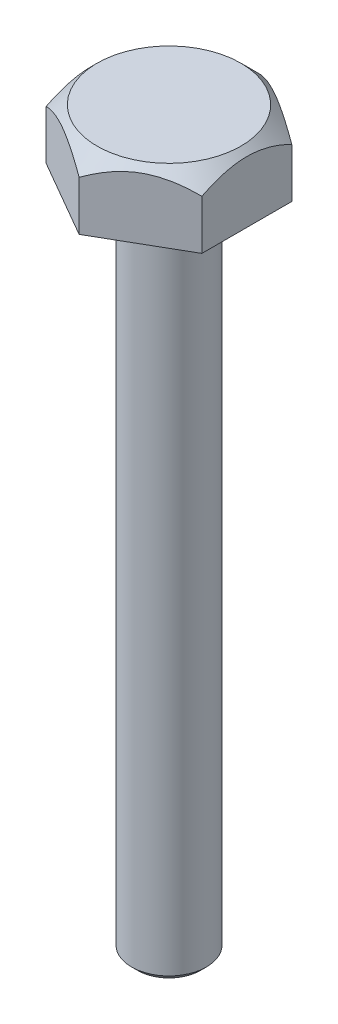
ISO-10303-21;
HEADER;
FILE_DESCRIPTION(('STEP AP214'),'2;1');
FILE_NAME('part.step','',(''),(''),'','','');
FILE_SCHEMA(('AUTOMOTIVE_DESIGN { 1 0 10303 214 1 1 1 1 }'));
ENDSEC;
DATA;
#1=APPLICATION_CONTEXT('core data for automotive mechanical design processes');
#2=APPLICATION_PROTOCOL_DEFINITION('international standard','automotive_design',2000,#1);
#3=PRODUCT_CONTEXT('',#1,'mechanical');
#4=PRODUCT('Part','Part','',(#3));
#5=PRODUCT_RELATED_PRODUCT_CATEGORY('part','',(#4));
#6=PRODUCT_DEFINITION_FORMATION('','',#4);
#7=PRODUCT_DEFINITION_CONTEXT('part definition',#1,'design');
#8=PRODUCT_DEFINITION('design','',#6,#7);
#9=PRODUCT_DEFINITION_SHAPE('','',#8);
#10=(LENGTH_UNIT() NAMED_UNIT(*) SI_UNIT(.MILLI.,.METRE.));
#11=(NAMED_UNIT(*) PLANE_ANGLE_UNIT() SI_UNIT($,.RADIAN.));
#12=(NAMED_UNIT(*) SI_UNIT($,.STERADIAN.) SOLID_ANGLE_UNIT());
#13=UNCERTAINTY_MEASURE_WITH_UNIT(LENGTH_MEASURE(1.E-05),#10,'distance_accuracy_value','');
#14=(GEOMETRIC_REPRESENTATION_CONTEXT(3) GLOBAL_UNCERTAINTY_ASSIGNED_CONTEXT((#13)) GLOBAL_UNIT_ASSIGNED_CONTEXT((#10,
#11,#12)) REPRESENTATION_CONTEXT('',''));
#15=CARTESIAN_POINT('',(0.,0.,0.));
#16=DIRECTION('',(0.,0.,1.));
#17=DIRECTION('',(1.,0.,0.));
#18=AXIS2_PLACEMENT_3D('',#15,#16,#17);
#19=CARTESIAN_POINT('',(-51.9615242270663,45.,30.));
#20=DIRECTION('',(0.5,0.,-0.866025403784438));
#21=DIRECTION('',(-0.866025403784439,0.,-0.5));
#22=AXIS2_PLACEMENT_3D('',#19,#20,#21);
#23=PLANE('',#22);
#24=DIRECTION('',(0.,-1.,0.));
#25=VECTOR('',#24,1.);
#26=CARTESIAN_POINT('',(0.,45.,60.));
#27=LINE('',#26,#25);
#28=CARTESIAN_POINT('',(0.,33.,60.));
#29=VERTEX_POINT('',#28);
#30=CARTESIAN_POINT('',(0.,0.,60.));
#31=VERTEX_POINT('',#30);
#32=EDGE_CURVE('E124',#29,#31,#27,.T.);
#33=ORIENTED_EDGE('',*,*,#32,.F.);
#34=CARTESIAN_POINT('',(0.000199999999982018,32.9998845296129,60.0001154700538));
#35=CARTESIAN_POINT('',(-0.446473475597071,33.257768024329,59.742228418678));
#36=CARTESIAN_POINT('',(-0.894867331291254,33.511667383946,59.48334810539));
#37=CARTESIAN_POINT('',(-1.79523609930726,34.0109203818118,58.963519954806));
#38=CARTESIAN_POINT('',(-2.24721119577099,34.2562735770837,58.7025720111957));
#39=CARTESIAN_POINT('',(-3.60908692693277,34.9788404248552,57.9162926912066));
#40=CARTESIAN_POINT('',(-4.52450736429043,35.4423114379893,57.3877744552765));
#41=CARTESIAN_POINT('',(-6.37580546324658,36.3297114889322,56.3189269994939));
#42=CARTESIAN_POINT('',(-7.31177024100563,36.7533989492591,55.7785474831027));
#43=CARTESIAN_POINT('',(-9.19908082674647,37.5520758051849,54.6889082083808));
#44=CARTESIAN_POINT('',(-10.1504242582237,37.9270726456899,54.1396498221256));
#45=CARTESIAN_POINT('',(-12.0531098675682,38.6164656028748,53.0411337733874));
#46=CARTESIAN_POINT('',(-13.004217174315,38.9317213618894,52.4920117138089));
#47=CARTESIAN_POINT('',(-14.9199226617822,39.5025105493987,51.3859786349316));
#48=CARTESIAN_POINT('',(-15.8845215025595,39.7580410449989,50.8290672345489));
#49=CARTESIAN_POINT('',(-17.8228197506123,40.2028769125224,49.7099902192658));
#50=CARTESIAN_POINT('',(-18.7964924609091,40.3923364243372,49.1478400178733));
#51=CARTESIAN_POINT('',(-20.7521341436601,40.7008476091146,48.0187497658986));
#52=CARTESIAN_POINT('',(-21.7341018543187,40.8199098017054,47.4518104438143));
#53=CARTESIAN_POINT('',(-23.4226474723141,40.9609139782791,46.4769281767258));
#54=CARTESIAN_POINT('',(-24.128131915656,41.0008457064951,46.0696165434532));
#55=CARTESIAN_POINT('',(-25.5399358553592,41.0423687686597,45.2545111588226));
#56=CARTESIAN_POINT('',(-26.2462553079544,41.0439620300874,44.8467174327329));
#57=CARTESIAN_POINT('',(-27.6584230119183,41.0087702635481,44.0314020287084));
#58=CARTESIAN_POINT('',(-28.3642710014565,40.9719713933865,43.6238805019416));
#59=CARTESIAN_POINT('',(-29.7737274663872,40.8605427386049,42.8101304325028));
#60=CARTESIAN_POINT('',(-30.4773359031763,40.7859123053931,42.4039019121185));
#61=CARTESIAN_POINT('',(-31.8816436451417,40.5998306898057,41.5931244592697));
#62=CARTESIAN_POINT('',(-32.5823390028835,40.4883399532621,41.1885778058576));
#63=CARTESIAN_POINT('',(-33.9788282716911,40.2301353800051,40.3823143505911));
#64=CARTESIAN_POINT('',(-34.6746221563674,40.0834213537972,39.9805975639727));
#65=CARTESIAN_POINT('',(-36.0601894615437,39.756722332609,39.1806399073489));
#66=CARTESIAN_POINT('',(-36.7499638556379,39.5767428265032,38.7823984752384));
#67=CARTESIAN_POINT('',(-38.1228790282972,39.1856485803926,37.9897455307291));
#68=CARTESIAN_POINT('',(-38.8060192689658,38.9745313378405,37.5953343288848));
#69=CARTESIAN_POINT('',(-40.5647294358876,38.3907949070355,36.5799425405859));
#70=CARTESIAN_POINT('',(-41.6348611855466,37.9962040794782,35.9621016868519));
#71=CARTESIAN_POINT('',(-43.7557928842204,37.1434830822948,34.7375811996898));
#72=CARTESIAN_POINT('',(-44.8065922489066,36.6853509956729,34.1309019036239));
#73=CARTESIAN_POINT('',(-46.885750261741,35.7157175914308,32.9304994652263));
#74=CARTESIAN_POINT('',(-47.9141678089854,35.2043841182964,32.3367423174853));
#75=CARTESIAN_POINT('',(-49.4425794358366,34.4024899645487,31.4543134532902));
#76=CARTESIAN_POINT('',(-49.9495483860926,34.1294532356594,31.1616147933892));
#77=CARTESIAN_POINT('',(-50.9589715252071,33.5725705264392,30.5788240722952));
#78=CARTESIAN_POINT('',(-51.4614260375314,33.2887253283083,30.2887318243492));
#79=CARTESIAN_POINT('',(-51.9617242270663,32.9998845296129,29.9998845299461));
#80=B_SPLINE_CURVE_WITH_KNOTS('',3,(#34,#35,#36,#37,#38,#39,#40,#41,#42,#43,#44,#45,#46,#47,#48,
#49,#50,#51,#52,#53,#54,#55,#56,#57,#58,#59,#60,#61,#62,#63,#64,#65,#66,#67,#68,#69,#70,#71,#72,
#73,#74,#75,#76,#77,#78,#79),.UNSPECIFIED.,.F.,.F.,(4,2,2,2,2,2,2,2,2,2,2,2,2,2,2,2,2,2,2,2,2,2,
4),(0.,1.72992162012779,3.45993277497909,6.92162378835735,10.4031336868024,13.8841106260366,
17.310390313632,20.7368382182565,24.1552380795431,27.5731269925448,30.0190953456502,
32.4649407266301,34.9116682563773,37.3584377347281,39.8078413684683,42.2572581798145,
44.7062711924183,47.1554811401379,51.0447978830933,54.9342319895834,58.8117474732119,
60.7494784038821,62.6870693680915),.UNSPECIFIED.);
#81=CARTESIAN_POINT('',(-51.9615242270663,33.,30.));
#82=VERTEX_POINT('',#81);
#83=EDGE_CURVE('E185',#29,#82,#80,.T.);
#84=ORIENTED_EDGE('',*,*,#83,.T.);
#85=DIRECTION('',(0.,-1.,0.));
#86=VECTOR('',#85,1.);
#87=CARTESIAN_POINT('',(-51.9615242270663,45.,30.));
#88=LINE('',#87,#86);
#89=CARTESIAN_POINT('',(-51.9615242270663,0.,30.));
#90=VERTEX_POINT('',#89);
#91=EDGE_CURVE('E65',#82,#90,#88,.T.);
#92=ORIENTED_EDGE('',*,*,#91,.T.);
#93=DIRECTION('',(0.866025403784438,0.,0.5));
#94=VECTOR('',#93,1.);
#95=CARTESIAN_POINT('',(-51.9615242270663,0.,30.));
#96=LINE('',#95,#94);
#97=EDGE_CURVE('E203',#90,#31,#96,.T.);
#98=ORIENTED_EDGE('',*,*,#97,.T.);
#99=EDGE_LOOP('',(#33,#84,#92,#98));
#100=FACE_BOUND('',#99,.T.);
#101=ADVANCED_FACE('F41',(#100),#23,.F.);
#102=CARTESIAN_POINT('',(0.,45.,60.));
#103=DIRECTION('',(-0.5,0.,-0.866025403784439));
#104=DIRECTION('',(-0.866025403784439,0.,0.5));
#105=AXIS2_PLACEMENT_3D('',#102,#103,#104);
#106=PLANE('',#105);
#107=DIRECTION('',(0.,-1.,0.));
#108=VECTOR('',#107,1.);
#109=CARTESIAN_POINT('',(51.9615242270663,45.,30.));
#110=LINE('',#109,#108);
#111=CARTESIAN_POINT('',(51.9615242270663,33.,30.0000000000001));
#112=VERTEX_POINT('',#111);
#113=CARTESIAN_POINT('',(51.9615242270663,0.,30.));
#114=VERTEX_POINT('',#113);
#115=EDGE_CURVE('E118',#112,#114,#110,.T.);
#116=ORIENTED_EDGE('',*,*,#115,.F.);
#117=CARTESIAN_POINT('',(51.9617242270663,32.9998845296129,29.9998845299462));
#118=CARTESIAN_POINT('',(51.5150507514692,33.257768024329,30.257771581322));
#119=CARTESIAN_POINT('',(51.0666568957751,33.511667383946,30.51665189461));
#120=CARTESIAN_POINT('',(50.1662881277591,34.0109203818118,31.036480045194));
#121=CARTESIAN_POINT('',(49.7143130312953,34.2562735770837,31.2974279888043));
#122=CARTESIAN_POINT('',(48.3524373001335,34.9788404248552,32.0837073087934));
#123=CARTESIAN_POINT('',(47.4370168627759,35.4423114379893,32.6122255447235));
#124=CARTESIAN_POINT('',(45.5857187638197,36.3297114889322,33.6810730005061));
#125=CARTESIAN_POINT('',(44.6497539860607,36.7533989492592,34.2214525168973));
#126=CARTESIAN_POINT('',(42.7624434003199,37.5520758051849,35.3110917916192));
#127=CARTESIAN_POINT('',(41.8110999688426,37.9270726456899,35.8603501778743));
#128=CARTESIAN_POINT('',(39.9084143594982,38.6164656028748,36.9588662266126));
#129=CARTESIAN_POINT('',(38.9573070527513,38.9317213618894,37.5079882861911));
#130=CARTESIAN_POINT('',(37.0416015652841,39.5025105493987,38.6140213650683));
#131=CARTESIAN_POINT('',(36.0770027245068,39.758041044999,39.1709327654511));
#132=CARTESIAN_POINT('',(34.138704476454,40.2028769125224,40.2900097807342));
#133=CARTESIAN_POINT('',(33.1650317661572,40.3923364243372,40.8521599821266));
#134=CARTESIAN_POINT('',(31.2093900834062,40.7008476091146,41.9812502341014));
#135=CARTESIAN_POINT('',(30.2274223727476,40.8199098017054,42.5481895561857));
#136=CARTESIAN_POINT('',(28.5388767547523,40.9609139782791,43.5230718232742));
#137=CARTESIAN_POINT('',(27.8333923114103,41.0008457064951,43.9303834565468));
#138=CARTESIAN_POINT('',(26.4215883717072,41.0423687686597,44.7454888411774));
#139=CARTESIAN_POINT('',(25.7152689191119,41.0439620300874,45.1532825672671));
#140=CARTESIAN_POINT('',(24.303101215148,41.0087702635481,45.9685979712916));
#141=CARTESIAN_POINT('',(23.5972532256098,40.9719713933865,46.3761194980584));
#142=CARTESIAN_POINT('',(22.1877967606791,40.8605427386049,47.1898695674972));
#143=CARTESIAN_POINT('',(21.48418832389,40.7859123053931,47.5960980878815));
#144=CARTESIAN_POINT('',(20.0798805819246,40.5998306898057,48.4068755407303));
#145=CARTESIAN_POINT('',(19.3791852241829,40.4883399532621,48.8114221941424));
#146=CARTESIAN_POINT('',(17.9826959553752,40.2301353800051,49.6176856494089));
#147=CARTESIAN_POINT('',(17.286902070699,40.0834213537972,50.0194024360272));
#148=CARTESIAN_POINT('',(15.9013347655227,39.756722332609,50.8193600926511));
#149=CARTESIAN_POINT('',(15.2115603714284,39.5767428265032,51.2176015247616));
#150=CARTESIAN_POINT('',(13.8386451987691,39.1856485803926,52.0102544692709));
#151=CARTESIAN_POINT('',(13.1555049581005,38.9745313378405,52.4046656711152));
#152=CARTESIAN_POINT('',(11.3967947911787,38.3907949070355,53.4200574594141));
#153=CARTESIAN_POINT('',(10.3266630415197,37.9962040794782,54.037898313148));
#154=CARTESIAN_POINT('',(8.20573134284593,37.1434830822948,55.2624188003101));
#155=CARTESIAN_POINT('',(7.15493197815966,36.6853509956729,55.869098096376));
#156=CARTESIAN_POINT('',(5.07577396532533,35.7157175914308,57.0695005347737));
#157=CARTESIAN_POINT('',(4.04735641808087,35.2043841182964,57.6632576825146));
#158=CARTESIAN_POINT('',(2.51894479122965,34.4024899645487,58.5456865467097));
#159=CARTESIAN_POINT('',(2.01197584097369,34.1294532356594,58.8383852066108));
#160=CARTESIAN_POINT('',(1.00255270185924,33.5725705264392,59.4211759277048));
#161=CARTESIAN_POINT('',(0.500098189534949,33.2887253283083,59.7112681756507));
#162=CARTESIAN_POINT('',(-0.000200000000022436,32.9998845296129,60.0001154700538));
#163=B_SPLINE_CURVE_WITH_KNOTS('',3,(#117,#118,#119,#120,#121,#122,#123,#124,#125,#126,#127,
#128,#129,#130,#131,#132,#133,#134,#135,#136,#137,#138,#139,#140,#141,#142,#143,#144,#145,#146,
#147,#148,#149,#150,#151,#152,#153,#154,#155,#156,#157,#158,#159,#160,#161,#162),.UNSPECIFIED.,
.F.,.F.,(4,2,2,2,2,2,2,2,2,2,2,2,2,2,2,2,2,2,2,2,2,2,4),(0.,1.72992162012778,3.4599327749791,
6.92162378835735,10.4031336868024,13.8841106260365,17.310390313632,20.7368382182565,
24.1552380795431,27.5731269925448,30.0190953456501,32.4649407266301,34.9116682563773,
37.3584377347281,39.8078413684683,42.2572581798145,44.7062711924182,47.1554811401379,
51.0447978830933,54.9342319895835,58.8117474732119,60.7494784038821,62.6870693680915),.UNSPECIFIED.);
#164=EDGE_CURVE('E178',#112,#29,#163,.T.);
#165=ORIENTED_EDGE('',*,*,#164,.T.);
#166=ORIENTED_EDGE('',*,*,#32,.T.);
#167=DIRECTION('',(0.866025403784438,0.,-0.5));
#168=VECTOR('',#167,1.);
#169=CARTESIAN_POINT('',(0.,0.,60.));
#170=LINE('',#169,#168);
#171=EDGE_CURVE('E207',#31,#114,#170,.T.);
#172=ORIENTED_EDGE('',*,*,#171,.T.);
#173=EDGE_LOOP('',(#116,#165,#166,#172));
#174=FACE_BOUND('',#173,.T.);
#175=ADVANCED_FACE('F191',(#174),#106,.F.);
#176=CARTESIAN_POINT('',(51.9615242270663,45.,30.));
#177=DIRECTION('',(-1.,0.,0.));
#178=DIRECTION('',(0.,0.,1.));
#179=AXIS2_PLACEMENT_3D('',#176,#177,#178);
#180=PLANE('',#179);
#181=DIRECTION('',(0.,-1.,0.));
#182=VECTOR('',#181,1.);
#183=CARTESIAN_POINT('',(51.9615242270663,45.,-30.));
#184=LINE('',#183,#182);
#185=CARTESIAN_POINT('',(51.9615242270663,33.,-30.));
#186=VERTEX_POINT('',#185);
#187=CARTESIAN_POINT('',(51.9615242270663,0.,-30.));
#188=VERTEX_POINT('',#187);
#189=EDGE_CURVE('E116',#186,#188,#184,.T.);
#190=ORIENTED_EDGE('',*,*,#189,.F.);
#191=CARTESIAN_POINT('',(51.9615242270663,-11.9539447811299,-91.1884341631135));
#192=CARTESIAN_POINT('',(51.9615242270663,-10.7839201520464,-89.8417320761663));
#193=CARTESIAN_POINT('',(51.9615242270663,-9.61745820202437,-88.4919233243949));
#194=CARTESIAN_POINT('',(51.9615242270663,-7.29270416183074,-85.7852524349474));
#195=CARTESIAN_POINT('',(51.9615242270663,-6.13441220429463,-84.4283901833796));
#196=CARTESIAN_POINT('',(51.9615242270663,-3.82654233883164,-81.7061808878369));
#197=CARTESIAN_POINT('',(51.9615242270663,-2.6769687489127,-80.3408301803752));
#198=CARTESIAN_POINT('',(51.9615242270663,-0.388401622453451,-77.6012929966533));
#199=CARTESIAN_POINT('',(51.9615242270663,0.750591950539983,-76.227106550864));
#200=CARTESIAN_POINT('',(51.9615242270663,3.04192952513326,-73.4377375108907));
#201=CARTESIAN_POINT('',(51.9615242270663,4.19399757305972,-72.0223280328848));
#202=CARTESIAN_POINT('',(51.9615242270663,6.4834398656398,-69.179658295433));
#203=CARTESIAN_POINT('',(51.9615242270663,7.62081407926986,-67.7523980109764));
#204=CARTESIAN_POINT('',(51.9615242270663,9.87814380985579,-64.8847053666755));
#205=CARTESIAN_POINT('',(51.9615242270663,10.9981034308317,-63.444276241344));
#206=CARTESIAN_POINT('',(51.9615242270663,13.2178668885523,-60.5479503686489));
#207=CARTESIAN_POINT('',(51.9615242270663,14.3176707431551,-59.0920536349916));
#208=CARTESIAN_POINT('',(51.9615242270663,16.4948023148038,-56.1605754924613));
#209=CARTESIAN_POINT('',(51.9615242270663,17.5720989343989,-54.6849709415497));
#210=CARTESIAN_POINT('',(51.9615242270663,19.6980400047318,-51.713203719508));
#211=CARTESIAN_POINT('',(51.9615242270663,20.7466841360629,-50.2170408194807));
#212=CARTESIAN_POINT('',(51.9615242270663,22.8102921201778,-47.1996672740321));
#213=CARTESIAN_POINT('',(51.9615242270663,23.8252262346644,-45.6784361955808));
#214=CARTESIAN_POINT('',(51.9615242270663,25.3158762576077,-43.3760511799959));
#215=CARTESIAN_POINT('',(51.9615242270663,25.8074716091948,-42.6051600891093));
#216=CARTESIAN_POINT('',(51.9615242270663,26.7789135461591,-41.0560174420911));
#217=CARTESIAN_POINT('',(51.9615242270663,27.2587603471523,-40.2777660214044));
#218=CARTESIAN_POINT('',(51.9615242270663,28.2019517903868,-38.7191054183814));
#219=CARTESIAN_POINT('',(51.9615242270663,28.6653916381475,-37.9387539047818));
#220=CARTESIAN_POINT('',(51.9615242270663,29.5779846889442,-36.3697576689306));
#221=CARTESIAN_POINT('',(51.9615242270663,30.0271382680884,-35.5811131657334));
#222=CARTESIAN_POINT('',(51.9615242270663,30.9096286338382,-33.9948329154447));
#223=CARTESIAN_POINT('',(51.9615242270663,31.342962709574,-33.1971956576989));
#224=CARTESIAN_POINT('',(51.9615242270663,32.191889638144,-31.5925596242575));
#225=CARTESIAN_POINT('',(51.9615242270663,32.6074831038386,-30.7855611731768));
#226=CARTESIAN_POINT('',(51.9615242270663,33.4183205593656,-29.1628148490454));
#227=CARTESIAN_POINT('',(51.9615242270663,33.8135929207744,-28.347081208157));
#228=CARTESIAN_POINT('',(51.9615242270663,34.5821197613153,-26.7053337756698));
#229=CARTESIAN_POINT('',(51.9615242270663,34.9553737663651,-25.8793197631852));
#230=CARTESIAN_POINT('',(51.9615242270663,36.0381625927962,-23.3857528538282));
#231=CARTESIAN_POINT('',(51.9615242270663,36.7111246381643,-21.7018840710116));
#232=CARTESIAN_POINT('',(51.9615242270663,37.6368932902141,-19.124219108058));
#233=CARTESIAN_POINT('',(51.9615242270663,37.9343551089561,-18.2462988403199));
#234=CARTESIAN_POINT('',(51.9615242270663,38.4943430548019,-16.4793427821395));
#235=CARTESIAN_POINT('',(51.9615242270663,38.7568706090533,-15.5903074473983));
#236=CARTESIAN_POINT('',(51.9615242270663,39.2435993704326,-13.8018426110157));
#237=CARTESIAN_POINT('',(51.9615242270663,39.4678033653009,-12.9024138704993));
#238=CARTESIAN_POINT('',(51.9615242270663,39.8746364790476,-11.0941512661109));
#239=CARTESIAN_POINT('',(51.9615242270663,40.0572654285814,-10.1853173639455));
#240=CARTESIAN_POINT('',(51.9615242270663,40.376948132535,-8.36556672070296));
#241=CARTESIAN_POINT('',(51.9615242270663,40.5142832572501,-7.45469964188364));
#242=CARTESIAN_POINT('',(51.9615242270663,40.7425323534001,-5.62714564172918));
#243=CARTESIAN_POINT('',(51.9615242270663,40.833446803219,-4.71045878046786));
#244=CARTESIAN_POINT('',(51.9615242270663,40.9671362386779,-2.87363606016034));
#245=CARTESIAN_POINT('',(51.9615242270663,41.0099150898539,-1.95350048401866));
#246=CARTESIAN_POINT('',(51.9615242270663,41.046507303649,-0.11225013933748));
#247=CARTESIAN_POINT('',(51.9615242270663,41.0403206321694,0.808864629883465));
#248=CARTESIAN_POINT('',(51.9615242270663,40.9790508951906,2.65106314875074));
#249=CARTESIAN_POINT('',(51.9615242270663,40.9238827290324,3.57214405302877));
#250=CARTESIAN_POINT('',(51.9615242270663,40.7656108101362,5.41015844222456));
#251=CARTESIAN_POINT('',(51.9615242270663,40.6625068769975,6.32709191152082));
#252=CARTESIAN_POINT('',(51.9615242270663,40.4102685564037,8.15470547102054));
#253=CARTESIAN_POINT('',(51.9615242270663,40.2611275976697,9.06538464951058));
#254=CARTESIAN_POINT('',(51.9615242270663,39.9194058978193,10.8785239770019));
#255=CARTESIAN_POINT('',(51.9615242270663,39.7268247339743,11.7809840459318));
#256=CARTESIAN_POINT('',(51.9615242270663,39.2997363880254,13.5827038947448));
#257=CARTESIAN_POINT('',(51.9615242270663,39.064939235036,14.4818946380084));
#258=CARTESIAN_POINT('',(51.9615242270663,38.5576890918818,16.2696043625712));
#259=CARTESIAN_POINT('',(51.9615242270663,38.2852338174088,17.1581226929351));
#260=CARTESIAN_POINT('',(51.9615242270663,37.7061037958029,18.9238090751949));
#261=CARTESIAN_POINT('',(51.9615242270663,37.3994320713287,19.8009781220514));
#262=CARTESIAN_POINT('',(51.9615242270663,36.7551574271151,21.543862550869));
#263=CARTESIAN_POINT('',(51.9615242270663,36.4175537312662,22.4095776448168));
#264=CARTESIAN_POINT('',(51.9615242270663,35.6394991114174,24.3132578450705));
#265=CARTESIAN_POINT('',(51.9615242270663,35.1924792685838,25.3485359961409));
#266=CARTESIAN_POINT('',(51.9615242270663,34.262603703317,27.4029349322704));
#267=CARTESIAN_POINT('',(51.9615242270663,33.7797439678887,28.4220538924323));
#268=CARTESIAN_POINT('',(51.9615242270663,32.7825369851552,30.4453286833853));
#269=CARTESIAN_POINT('',(51.9615242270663,32.2681748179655,31.4494771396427));
#270=CARTESIAN_POINT('',(51.9615242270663,31.2121718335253,33.4432455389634));
#271=CARTESIAN_POINT('',(51.9615242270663,30.6705318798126,34.4328659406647));
#272=CARTESIAN_POINT('',(51.9615242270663,29.5622785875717,36.4006428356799));
#273=CARTESIAN_POINT('',(51.9615242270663,28.9956167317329,37.378771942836));
#274=CARTESIAN_POINT('',(51.9615242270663,27.841327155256,39.3225648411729));
#275=CARTESIAN_POINT('',(51.9615242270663,27.2536992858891,40.2882285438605));
#276=CARTESIAN_POINT('',(51.9615242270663,26.0601730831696,42.2078832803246));
#277=CARTESIAN_POINT('',(51.9615242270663,25.454278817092,43.1618768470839));
#278=CARTESIAN_POINT('',(51.9615242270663,24.2262913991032,45.0593617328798));
#279=CARTESIAN_POINT('',(51.9615242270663,23.6041982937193,46.0028530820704));
#280=CARTESIAN_POINT('',(51.9615242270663,22.3423126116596,47.885270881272));
#281=CARTESIAN_POINT('',(51.9615242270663,21.7024428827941,48.8241455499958));
#282=CARTESIAN_POINT('',(51.9615242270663,20.4098754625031,50.6930134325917));
#283=CARTESIAN_POINT('',(51.9615242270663,19.7571777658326,51.6230066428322));
#284=CARTESIAN_POINT('',(51.9615242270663,18.4403559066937,53.4748955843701));
#285=CARTESIAN_POINT('',(51.9615242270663,17.7762314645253,54.3967911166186));
#286=CARTESIAN_POINT('',(51.9615242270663,16.4377847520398,56.2331545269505));
#287=CARTESIAN_POINT('',(51.9615242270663,15.763462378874,57.1476223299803));
#288=CARTESIAN_POINT('',(51.9615242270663,13.7284008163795,59.8787281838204));
#289=CARTESIAN_POINT('',(51.9615242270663,12.3540306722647,61.6852191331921));
#290=CARTESIAN_POINT('',(51.9615242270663,9.57591437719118,65.2753374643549));
#291=CARTESIAN_POINT('',(51.9615242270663,8.17216885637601,67.0589653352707));
#292=CARTESIAN_POINT('',(51.9615242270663,5.99432454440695,69.7876607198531));
#293=CARTESIAN_POINT('',(51.9615242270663,5.22881532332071,70.7396018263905));
#294=CARTESIAN_POINT('',(51.9615242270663,3.6914502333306,72.6383335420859));
#295=CARTESIAN_POINT('',(51.9615242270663,2.91959441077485,73.5851241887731));
#296=CARTESIAN_POINT('',(51.9615242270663,0.595122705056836,76.4187820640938));
#297=CARTESIAN_POINT('',(51.9615242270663,-0.966114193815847,78.2985812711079));
#298=CARTESIAN_POINT('',(51.9615242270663,-4.08989095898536,82.02109080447));
#299=CARTESIAN_POINT('',(51.9615242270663,-5.65221763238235,83.8639803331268));
#300=CARTESIAN_POINT('',(51.9615242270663,-8.00725193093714,86.618075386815));
#301=CARTESIAN_POINT('',(51.9615242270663,-8.79409984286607,87.5342998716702));
#302=CARTESIAN_POINT('',(51.9615242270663,-10.3713963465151,89.3636391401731));
#303=CARTESIAN_POINT('',(51.9615242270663,-11.1618449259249,90.2767539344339));
#304=CARTESIAN_POINT('',(51.9615242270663,-11.9539447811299,91.1884341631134));
#305=B_SPLINE_CURVE_WITH_KNOTS('',3,(#191,#192,#193,#194,#195,#196,#197,#198,#199,#200,#201,
#202,#203,#204,#205,#206,#207,#208,#209,#210,#211,#212,#213,#214,#215,#216,#217,#218,#219,#220,
#221,#222,#223,#224,#225,#226,#227,#228,#229,#230,#231,#232,#233,#234,#235,#236,#237,#238,#239,
#240,#241,#242,#243,#244,#245,#246,#247,#248,#249,#250,#251,#252,#253,#254,#255,#256,#257,#258,
#259,#260,#261,#262,#263,#264,#265,#266,#267,#268,#269,#270,#271,#272,#273,#274,#275,#276,#277,
#278,#279,#280,#281,#282,#283,#284,#285,#286,#287,#288,#289,#290,#291,#292,#293,#294,#295,#296,
#297,#298,#299,#300,#301,#302,#303,#304),.UNSPECIFIED.,.F.,.F.,(4,2,2,2,2,2,2,2,2,2,2,2,2,2,2,2,
2,2,2,2,2,2,2,2,2,2,2,2,2,2,2,2,2,2,2,2,2,2,2,2,2,2,2,2,2,2,2,2,2,2,2,2,2,2,2,2,4),(0.,
5.35192925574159,10.7039451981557,16.0584583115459,21.4129529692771,26.8878845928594,
32.3628277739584,37.8364605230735,43.3100884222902,48.7908363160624,54.2716452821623,
59.7571673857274,62.4999730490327,65.2427283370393,67.9653715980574,70.687943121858,
73.4109790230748,76.1339207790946,78.8529514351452,81.5720406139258,87.007562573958,
89.7878258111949,92.5679754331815,95.3479227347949,98.1278813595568,100.890230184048,
103.652550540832,106.414649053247,109.176749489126,111.943658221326,114.71057736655,
117.477891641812,120.245232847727,123.032363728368,125.819663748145,128.606717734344,
131.393841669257,134.776031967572,138.158601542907,141.54278571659,144.92686282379,
148.317817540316,151.708796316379,155.099025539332,158.489245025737,161.897683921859,
165.306124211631,168.714648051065,172.123206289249,178.932395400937,185.741438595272,
189.406078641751,193.070691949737,200.401278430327,207.649206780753,211.272370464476,
214.895521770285),.UNSPECIFIED.);
#306=EDGE_CURVE('E98',#186,#112,#305,.T.);
#307=ORIENTED_EDGE('',*,*,#306,.T.);
#308=ORIENTED_EDGE('',*,*,#115,.T.);
#309=DIRECTION('',(0.,0.,-1.));
#310=VECTOR('',#309,1.);
#311=CARTESIAN_POINT('',(51.9615242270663,0.,30.));
#312=LINE('',#311,#310);
#313=EDGE_CURVE('E212',#114,#188,#312,.T.);
#314=ORIENTED_EDGE('',*,*,#313,.T.);
#315=EDGE_LOOP('',(#190,#307,#308,#314));
#316=FACE_BOUND('',#315,.T.);
#317=ADVANCED_FACE('F194',(#316),#180,.F.);
#318=CARTESIAN_POINT('',(51.9615242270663,45.,-30.));
#319=DIRECTION('',(-0.5,0.,0.866025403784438));
#320=DIRECTION('',(0.866025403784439,0.,0.5));
#321=AXIS2_PLACEMENT_3D('',#318,#319,#320);
#322=PLANE('',#321);
#323=DIRECTION('',(0.,-1.,0.));
#324=VECTOR('',#323,1.);
#325=CARTESIAN_POINT('',(0.,45.,-60.));
#326=LINE('',#325,#324);
#327=CARTESIAN_POINT('',(0.,33.,-60.));
#328=VERTEX_POINT('',#327);
#329=CARTESIAN_POINT('',(0.,0.,-60.));
#330=VERTEX_POINT('',#329);
#331=EDGE_CURVE('E107',#328,#330,#326,.T.);
#332=ORIENTED_EDGE('',*,*,#331,.F.);
#333=CARTESIAN_POINT('',(-0.000199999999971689,32.9998845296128,-60.0001154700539));
#334=CARTESIAN_POINT('',(0.446473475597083,33.257768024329,-59.742228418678));
#335=CARTESIAN_POINT('',(0.894867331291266,33.5116673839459,-59.48334810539));
#336=CARTESIAN_POINT('',(1.79523609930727,34.0109203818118,-58.963519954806));
#337=CARTESIAN_POINT('',(2.247211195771,34.2562735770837,-58.7025720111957));
#338=CARTESIAN_POINT('',(3.60908692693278,34.9788404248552,-57.9162926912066));
#339=CARTESIAN_POINT('',(4.52450736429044,35.4423114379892,-57.3877744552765));
#340=CARTESIAN_POINT('',(6.3758054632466,36.3297114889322,-56.3189269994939));
#341=CARTESIAN_POINT('',(7.31177024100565,36.7533989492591,-55.7785474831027));
#342=CARTESIAN_POINT('',(9.19908082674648,37.5520758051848,-54.6889082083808));
#343=CARTESIAN_POINT('',(10.1504242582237,37.9270726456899,-54.1396498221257));
#344=CARTESIAN_POINT('',(12.0531098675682,38.6164656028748,-53.0411337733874));
#345=CARTESIAN_POINT('',(13.004217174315,38.9317213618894,-52.4920117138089));
#346=CARTESIAN_POINT('',(14.9199226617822,39.5025105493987,-51.3859786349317));
#347=CARTESIAN_POINT('',(15.8845215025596,39.7580410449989,-50.8290672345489));
#348=CARTESIAN_POINT('',(17.8228197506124,40.2028769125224,-49.7099902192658));
#349=CARTESIAN_POINT('',(18.7964924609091,40.3923364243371,-49.1478400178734));
#350=CARTESIAN_POINT('',(20.7521341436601,40.7008476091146,-48.0187497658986));
#351=CARTESIAN_POINT('',(21.7341018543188,40.8199098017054,-47.4518104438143));
#352=CARTESIAN_POINT('',(23.4226474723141,40.9609139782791,-46.4769281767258));
#353=CARTESIAN_POINT('',(24.1281319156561,41.0008457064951,-46.0696165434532));
#354=CARTESIAN_POINT('',(25.5399358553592,41.0423687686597,-45.2545111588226));
#355=CARTESIAN_POINT('',(26.2462553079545,41.0439620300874,-44.8467174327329));
#356=CARTESIAN_POINT('',(27.6584230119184,41.008770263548,-44.0314020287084));
#357=CARTESIAN_POINT('',(28.3642710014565,40.9719713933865,-43.6238805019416));
#358=CARTESIAN_POINT('',(29.7737274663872,40.8605427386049,-42.8101304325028));
#359=CARTESIAN_POINT('',(30.4773359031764,40.7859123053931,-42.4039019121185));
#360=CARTESIAN_POINT('',(31.8816436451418,40.5998306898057,-41.5931244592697));
#361=CARTESIAN_POINT('',(32.5823390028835,40.4883399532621,-41.1885778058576));
#362=CARTESIAN_POINT('',(33.9788282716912,40.230135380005,-40.3823143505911));
#363=CARTESIAN_POINT('',(34.6746221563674,40.0834213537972,-39.9805975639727));
#364=CARTESIAN_POINT('',(36.0601894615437,39.7567223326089,-39.1806399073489));
#365=CARTESIAN_POINT('',(36.749963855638,39.5767428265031,-38.7823984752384));
#366=CARTESIAN_POINT('',(38.1228790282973,39.1856485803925,-37.9897455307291));
#367=CARTESIAN_POINT('',(38.8060192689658,38.9745313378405,-37.5953343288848));
#368=CARTESIAN_POINT('',(40.5647294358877,38.3907949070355,-36.5799425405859));
#369=CARTESIAN_POINT('',(41.6348611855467,37.9962040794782,-35.9621016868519));
#370=CARTESIAN_POINT('',(43.7557928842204,37.1434830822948,-34.7375811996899));
#371=CARTESIAN_POINT('',(44.8065922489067,36.6853509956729,-34.130901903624));
#372=CARTESIAN_POINT('',(46.885750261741,35.7157175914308,-32.9304994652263));
#373=CARTESIAN_POINT('',(47.9141678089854,35.2043841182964,-32.3367423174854));
#374=CARTESIAN_POINT('',(49.4425794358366,34.4024899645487,-31.4543134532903));
#375=CARTESIAN_POINT('',(49.9495483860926,34.1294532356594,-31.1616147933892));
#376=CARTESIAN_POINT('',(50.958971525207,33.5725705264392,-30.5788240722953));
#377=CARTESIAN_POINT('',(51.4614260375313,33.2887253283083,-30.2887318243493));
#378=CARTESIAN_POINT('',(51.9617242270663,32.9998845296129,-29.9998845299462));
#379=B_SPLINE_CURVE_WITH_KNOTS('',3,(#333,#334,#335,#336,#337,#338,#339,#340,#341,#342,#343,
#344,#345,#346,#347,#348,#349,#350,#351,#352,#353,#354,#355,#356,#357,#358,#359,#360,#361,#362,
#363,#364,#365,#366,#367,#368,#369,#370,#371,#372,#373,#374,#375,#376,#377,#378),.UNSPECIFIED.,
.F.,.F.,(4,2,2,2,2,2,2,2,2,2,2,2,2,2,2,2,2,2,2,2,2,2,4),(0.,1.72992162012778,3.45993277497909,
6.92162378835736,10.4031336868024,13.8841106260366,17.310390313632,20.7368382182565,
24.1552380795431,27.5731269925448,30.0190953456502,32.4649407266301,34.9116682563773,
37.3584377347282,39.8078413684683,42.2572581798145,44.7062711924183,47.1554811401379,
51.0447978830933,54.9342319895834,58.8117474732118,60.7494784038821,62.6870693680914),.UNSPECIFIED.);
#380=EDGE_CURVE('E95',#328,#186,#379,.T.);
#381=ORIENTED_EDGE('',*,*,#380,.T.);
#382=ORIENTED_EDGE('',*,*,#189,.T.);
#383=DIRECTION('',(-0.866025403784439,0.,-0.5));
#384=VECTOR('',#383,1.);
#385=CARTESIAN_POINT('',(51.9615242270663,0.,-30.));
#386=LINE('',#385,#384);
#387=EDGE_CURVE('E114',#188,#330,#386,.T.);
#388=ORIENTED_EDGE('',*,*,#387,.T.);
#389=EDGE_LOOP('',(#332,#381,#382,#388));
#390=FACE_BOUND('',#389,.T.);
#391=ADVANCED_FACE('F112',(#390),#322,.F.);
#392=CARTESIAN_POINT('',(0.,45.,-60.));
#393=DIRECTION('',(0.5,0.,0.866025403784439));
#394=DIRECTION('',(0.866025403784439,0.,-0.5));
#395=AXIS2_PLACEMENT_3D('',#392,#393,#394);
#396=PLANE('',#395);
#397=DIRECTION('',(0.,-1.,0.));
#398=VECTOR('',#397,1.);
#399=CARTESIAN_POINT('',(-51.9615242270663,45.,-30.));
#400=LINE('',#399,#398);
#401=CARTESIAN_POINT('',(-51.9615242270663,33.,-30.));
#402=VERTEX_POINT('',#401);
#403=CARTESIAN_POINT('',(-51.9615242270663,0.,-30.));
#404=VERTEX_POINT('',#403);
#405=EDGE_CURVE('E109',#402,#404,#400,.T.);
#406=ORIENTED_EDGE('',*,*,#405,.F.);
#407=CARTESIAN_POINT('',(-51.9617242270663,32.9998845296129,-29.9998845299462));
#408=CARTESIAN_POINT('',(-51.5150507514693,33.257768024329,-30.257771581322));
#409=CARTESIAN_POINT('',(-51.0666568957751,33.511667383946,-30.51665189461));
#410=CARTESIAN_POINT('',(-50.1662881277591,34.0109203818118,-31.036480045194));
#411=CARTESIAN_POINT('',(-49.7143130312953,34.2562735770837,-31.2974279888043));
#412=CARTESIAN_POINT('',(-48.3524373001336,34.9788404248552,-32.0837073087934));
#413=CARTESIAN_POINT('',(-47.4370168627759,35.4423114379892,-32.6122255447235));
#414=CARTESIAN_POINT('',(-45.5857187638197,36.3297114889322,-33.6810730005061));
#415=CARTESIAN_POINT('',(-44.6497539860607,36.7533989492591,-34.2214525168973));
#416=CARTESIAN_POINT('',(-42.7624434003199,37.5520758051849,-35.3110917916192));
#417=CARTESIAN_POINT('',(-41.8110999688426,37.9270726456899,-35.8603501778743));
#418=CARTESIAN_POINT('',(-39.9084143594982,38.6164656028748,-36.9588662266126));
#419=CARTESIAN_POINT('',(-38.9573070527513,38.9317213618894,-37.5079882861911));
#420=CARTESIAN_POINT('',(-37.0416015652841,39.5025105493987,-38.6140213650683));
#421=CARTESIAN_POINT('',(-36.0770027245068,39.7580410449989,-39.1709327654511));
#422=CARTESIAN_POINT('',(-34.138704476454,40.2028769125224,-40.2900097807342));
#423=CARTESIAN_POINT('',(-33.1650317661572,40.3923364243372,-40.8521599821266));
#424=CARTESIAN_POINT('',(-31.2093900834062,40.7008476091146,-41.9812502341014));
#425=CARTESIAN_POINT('',(-30.2274223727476,40.8199098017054,-42.5481895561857));
#426=CARTESIAN_POINT('',(-28.5388767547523,40.9609139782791,-43.5230718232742));
#427=CARTESIAN_POINT('',(-27.8333923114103,41.0008457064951,-43.9303834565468));
#428=CARTESIAN_POINT('',(-26.4215883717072,41.0423687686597,-44.7454888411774));
#429=CARTESIAN_POINT('',(-25.7152689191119,41.0439620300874,-45.1532825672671));
#430=CARTESIAN_POINT('',(-24.303101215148,41.0087702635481,-45.9685979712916));
#431=CARTESIAN_POINT('',(-23.5972532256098,40.9719713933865,-46.3761194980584));
#432=CARTESIAN_POINT('',(-22.1877967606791,40.8605427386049,-47.1898695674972));
#433=CARTESIAN_POINT('',(-21.48418832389,40.7859123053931,-47.5960980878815));
#434=CARTESIAN_POINT('',(-20.0798805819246,40.5998306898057,-48.4068755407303));
#435=CARTESIAN_POINT('',(-19.3791852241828,40.4883399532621,-48.8114221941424));
#436=CARTESIAN_POINT('',(-17.9826959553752,40.2301353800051,-49.6176856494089));
#437=CARTESIAN_POINT('',(-17.2869020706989,40.0834213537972,-50.0194024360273));
#438=CARTESIAN_POINT('',(-15.9013347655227,39.7567223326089,-50.8193600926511));
#439=CARTESIAN_POINT('',(-15.2115603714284,39.5767428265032,-51.2176015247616));
#440=CARTESIAN_POINT('',(-13.8386451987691,39.1856485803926,-52.0102544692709));
#441=CARTESIAN_POINT('',(-13.1555049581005,38.9745313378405,-52.4046656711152));
#442=CARTESIAN_POINT('',(-11.3967947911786,38.3907949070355,-53.4200574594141));
#443=CARTESIAN_POINT('',(-10.3266630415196,37.9962040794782,-54.0378983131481));
#444=CARTESIAN_POINT('',(-8.20573134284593,37.1434830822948,-55.2624188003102));
#445=CARTESIAN_POINT('',(-7.15493197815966,36.6853509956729,-55.8690980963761));
#446=CARTESIAN_POINT('',(-5.07577396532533,35.7157175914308,-57.0695005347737));
#447=CARTESIAN_POINT('',(-4.04735641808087,35.2043841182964,-57.6632576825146));
#448=CARTESIAN_POINT('',(-2.51894479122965,34.4024899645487,-58.5456865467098));
#449=CARTESIAN_POINT('',(-2.01197584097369,34.1294532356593,-58.8383852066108));
#450=CARTESIAN_POINT('',(-1.00255270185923,33.5725705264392,-59.4211759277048));
#451=CARTESIAN_POINT('',(-0.500098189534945,33.2887253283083,-59.7112681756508));
#452=CARTESIAN_POINT('',(0.000200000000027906,32.9998845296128,-60.0001154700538));
#453=B_SPLINE_CURVE_WITH_KNOTS('',3,(#407,#408,#409,#410,#411,#412,#413,#414,#415,#416,#417,
#418,#419,#420,#421,#422,#423,#424,#425,#426,#427,#428,#429,#430,#431,#432,#433,#434,#435,#436,
#437,#438,#439,#440,#441,#442,#443,#444,#445,#446,#447,#448,#449,#450,#451,#452),.UNSPECIFIED.,
.F.,.F.,(4,2,2,2,2,2,2,2,2,2,2,2,2,2,2,2,2,2,2,2,2,2,4),(0.,1.72992162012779,3.45993277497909,
6.92162378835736,10.4031336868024,13.8841106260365,17.310390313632,20.7368382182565,
24.1552380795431,27.5731269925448,30.0190953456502,32.4649407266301,34.9116682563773,
37.3584377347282,39.8078413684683,42.2572581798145,44.7062711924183,47.1554811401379,
51.0447978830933,54.9342319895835,58.8117474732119,60.7494784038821,62.6870693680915),.UNSPECIFIED.);
#454=EDGE_CURVE('E57',#402,#328,#453,.T.);
#455=ORIENTED_EDGE('',*,*,#454,.T.);
#456=ORIENTED_EDGE('',*,*,#331,.T.);
#457=DIRECTION('',(-0.866025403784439,0.,0.5));
#458=VECTOR('',#457,1.);
#459=CARTESIAN_POINT('',(0.,0.,-60.));
#460=LINE('',#459,#458);
#461=EDGE_CURVE('E217',#330,#404,#460,.T.);
#462=ORIENTED_EDGE('',*,*,#461,.T.);
#463=EDGE_LOOP('',(#406,#455,#456,#462));
#464=FACE_BOUND('',#463,.T.);
#465=ADVANCED_FACE('F105',(#464),#396,.F.);
#466=CARTESIAN_POINT('',(-51.9615242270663,45.,-30.));
#467=DIRECTION('',(1.,0.,0.));
#468=DIRECTION('',(0.,0.,-1.));
#469=AXIS2_PLACEMENT_3D('',#466,#467,#468);
#470=PLANE('',#469);
#471=ORIENTED_EDGE('',*,*,#91,.F.);
#472=CARTESIAN_POINT('',(-51.9615242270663,-11.9539447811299,91.1884341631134));
#473=CARTESIAN_POINT('',(-51.9615242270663,-10.7839201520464,89.8417320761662));
#474=CARTESIAN_POINT('',(-51.9615242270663,-9.61745820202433,88.4919233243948));
#475=CARTESIAN_POINT('',(-51.9615242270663,-7.29270416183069,85.7852524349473));
#476=CARTESIAN_POINT('',(-51.9615242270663,-6.13441220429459,84.4283901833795));
#477=CARTESIAN_POINT('',(-51.9615242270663,-3.82654233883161,81.7061808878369));
#478=CARTESIAN_POINT('',(-51.9615242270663,-2.67696874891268,80.3408301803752));
#479=CARTESIAN_POINT('',(-51.9615242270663,-0.388401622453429,77.6012929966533));
#480=CARTESIAN_POINT('',(-51.9615242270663,0.750591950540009,76.2271065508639));
#481=CARTESIAN_POINT('',(-51.9615242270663,3.04192952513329,73.4377375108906));
#482=CARTESIAN_POINT('',(-51.9615242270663,4.19399757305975,72.0223280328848));
#483=CARTESIAN_POINT('',(-51.9615242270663,6.48343986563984,69.1796582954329));
#484=CARTESIAN_POINT('',(-51.9615242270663,7.62081407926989,67.7523980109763));
#485=CARTESIAN_POINT('',(-51.9615242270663,9.87814380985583,64.8847053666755));
#486=CARTESIAN_POINT('',(-51.9615242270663,10.9981034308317,63.4442762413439));
#487=CARTESIAN_POINT('',(-51.9615242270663,13.2178668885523,60.5479503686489));
#488=CARTESIAN_POINT('',(-51.9615242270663,14.3176707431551,59.0920536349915));
#489=CARTESIAN_POINT('',(-51.9615242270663,16.4948023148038,56.1605754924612));
#490=CARTESIAN_POINT('',(-51.9615242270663,17.5720989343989,54.6849709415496));
#491=CARTESIAN_POINT('',(-51.9615242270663,19.6980400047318,51.713203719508));
#492=CARTESIAN_POINT('',(-51.9615242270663,20.7466841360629,50.2170408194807));
#493=CARTESIAN_POINT('',(-51.9615242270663,22.8102921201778,47.199667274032));
#494=CARTESIAN_POINT('',(-51.9615242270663,23.8252262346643,45.6784361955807));
#495=CARTESIAN_POINT('',(-51.9615242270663,25.3158762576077,43.3760511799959));
#496=CARTESIAN_POINT('',(-51.9615242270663,25.8074716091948,42.6051600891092));
#497=CARTESIAN_POINT('',(-51.9615242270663,26.7789135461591,41.0560174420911));
#498=CARTESIAN_POINT('',(-51.9615242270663,27.2587603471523,40.2777660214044));
#499=CARTESIAN_POINT('',(-51.9615242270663,28.2019517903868,38.7191054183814));
#500=CARTESIAN_POINT('',(-51.9615242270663,28.6653916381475,37.9387539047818));
#501=CARTESIAN_POINT('',(-51.9615242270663,29.5779846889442,36.3697576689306));
#502=CARTESIAN_POINT('',(-51.9615242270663,30.0271382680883,35.5811131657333));
#503=CARTESIAN_POINT('',(-51.9615242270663,30.9096286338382,33.9948329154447));
#504=CARTESIAN_POINT('',(-51.9615242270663,31.342962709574,33.1971956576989));
#505=CARTESIAN_POINT('',(-51.9615242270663,32.191889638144,31.5925596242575));
#506=CARTESIAN_POINT('',(-51.9615242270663,32.6074831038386,30.7855611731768));
#507=CARTESIAN_POINT('',(-51.9615242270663,33.4183205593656,29.1628148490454));
#508=CARTESIAN_POINT('',(-51.9615242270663,33.8135929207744,28.347081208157));
#509=CARTESIAN_POINT('',(-51.9615242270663,34.5821197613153,26.7053337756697));
#510=CARTESIAN_POINT('',(-51.9615242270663,34.955373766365,25.8793197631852));
#511=CARTESIAN_POINT('',(-51.9615242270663,36.0381625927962,23.3857528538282));
#512=CARTESIAN_POINT('',(-51.9615242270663,36.7111246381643,21.7018840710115));
#513=CARTESIAN_POINT('',(-51.9615242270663,37.6368932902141,19.124219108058));
#514=CARTESIAN_POINT('',(-51.9615242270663,37.9343551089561,18.2462988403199));
#515=CARTESIAN_POINT('',(-51.9615242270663,38.4943430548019,16.4793427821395));
#516=CARTESIAN_POINT('',(-51.9615242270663,38.7568706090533,15.5903074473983));
#517=CARTESIAN_POINT('',(-51.9615242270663,39.2435993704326,13.8018426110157));
#518=CARTESIAN_POINT('',(-51.9615242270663,39.4678033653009,12.9024138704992));
#519=CARTESIAN_POINT('',(-51.9615242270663,39.8746364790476,11.0941512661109));
#520=CARTESIAN_POINT('',(-51.9615242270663,40.0572654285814,10.1853173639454));
#521=CARTESIAN_POINT('',(-51.9615242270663,40.376948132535,8.36556672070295));
#522=CARTESIAN_POINT('',(-51.9615242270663,40.5142832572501,7.45469964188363));
#523=CARTESIAN_POINT('',(-51.9615242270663,40.7425323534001,5.62714564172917));
#524=CARTESIAN_POINT('',(-51.9615242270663,40.833446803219,4.71045878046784));
#525=CARTESIAN_POINT('',(-51.9615242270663,40.9671362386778,2.87363606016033));
#526=CARTESIAN_POINT('',(-51.9615242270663,41.0099150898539,1.95350048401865));
#527=CARTESIAN_POINT('',(-51.9615242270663,41.046507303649,0.112250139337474));
#528=CARTESIAN_POINT('',(-51.9615242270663,41.0403206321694,-0.808864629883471));
#529=CARTESIAN_POINT('',(-51.9615242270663,40.9790508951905,-2.65106314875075));
#530=CARTESIAN_POINT('',(-51.9615242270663,40.9238827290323,-3.57214405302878));
#531=CARTESIAN_POINT('',(-51.9615242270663,40.7656108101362,-5.41015844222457));
#532=CARTESIAN_POINT('',(-51.9615242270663,40.6625068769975,-6.32709191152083));
#533=CARTESIAN_POINT('',(-51.9615242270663,40.4102685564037,-8.15470547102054));
#534=CARTESIAN_POINT('',(-51.9615242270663,40.2611275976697,-9.06538464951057));
#535=CARTESIAN_POINT('',(-51.9615242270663,39.9194058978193,-10.8785239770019));
#536=CARTESIAN_POINT('',(-51.9615242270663,39.7268247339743,-11.7809840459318));
#537=CARTESIAN_POINT('',(-51.9615242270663,39.2997363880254,-13.5827038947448));
#538=CARTESIAN_POINT('',(-51.9615242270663,39.064939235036,-14.4818946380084));
#539=CARTESIAN_POINT('',(-51.9615242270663,38.5576890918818,-16.2696043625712));
#540=CARTESIAN_POINT('',(-51.9615242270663,38.2852338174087,-17.158122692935));
#541=CARTESIAN_POINT('',(-51.9615242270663,37.7061037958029,-18.9238090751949));
#542=CARTESIAN_POINT('',(-51.9615242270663,37.3994320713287,-19.8009781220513));
#543=CARTESIAN_POINT('',(-51.9615242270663,36.7551574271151,-21.543862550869));
#544=CARTESIAN_POINT('',(-51.9615242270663,36.4175537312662,-22.4095776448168));
#545=CARTESIAN_POINT('',(-51.9615242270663,35.6394991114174,-24.3132578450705));
#546=CARTESIAN_POINT('',(-51.9615242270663,35.1924792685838,-25.3485359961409));
#547=CARTESIAN_POINT('',(-51.9615242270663,34.2626037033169,-27.4029349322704));
#548=CARTESIAN_POINT('',(-51.9615242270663,33.7797439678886,-28.4220538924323));
#549=CARTESIAN_POINT('',(-51.9615242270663,32.7825369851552,-30.4453286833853));
#550=CARTESIAN_POINT('',(-51.9615242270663,32.2681748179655,-31.4494771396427));
#551=CARTESIAN_POINT('',(-51.9615242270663,31.2121718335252,-33.4432455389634));
#552=CARTESIAN_POINT('',(-51.9615242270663,30.6705318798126,-34.4328659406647));
#553=CARTESIAN_POINT('',(-51.9615242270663,29.5622785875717,-36.4006428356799));
#554=CARTESIAN_POINT('',(-51.9615242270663,28.9956167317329,-37.3787719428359));
#555=CARTESIAN_POINT('',(-51.9615242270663,27.8413271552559,-39.3225648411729));
#556=CARTESIAN_POINT('',(-51.9615242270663,27.2536992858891,-40.2882285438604));
#557=CARTESIAN_POINT('',(-51.9615242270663,26.0601730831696,-42.2078832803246));
#558=CARTESIAN_POINT('',(-51.9615242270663,25.454278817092,-43.1618768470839));
#559=CARTESIAN_POINT('',(-51.9615242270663,24.2262913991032,-45.0593617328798));
#560=CARTESIAN_POINT('',(-51.9615242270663,23.6041982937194,-46.0028530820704));
#561=CARTESIAN_POINT('',(-51.9615242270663,22.3423126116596,-47.8852708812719));
#562=CARTESIAN_POINT('',(-51.9615242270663,21.7024428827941,-48.8241455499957));
#563=CARTESIAN_POINT('',(-51.9615242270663,20.4098754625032,-50.6930134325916));
#564=CARTESIAN_POINT('',(-51.9615242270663,19.7571777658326,-51.6230066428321));
#565=CARTESIAN_POINT('',(-51.9615242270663,18.4403559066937,-53.47489558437));
#566=CARTESIAN_POINT('',(-51.9615242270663,17.7762314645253,-54.3967911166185));
#567=CARTESIAN_POINT('',(-51.9615242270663,16.4377847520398,-56.2331545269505));
#568=CARTESIAN_POINT('',(-51.9615242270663,15.7634623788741,-57.1476223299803));
#569=CARTESIAN_POINT('',(-51.9615242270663,13.7284008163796,-59.8787281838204));
#570=CARTESIAN_POINT('',(-51.9615242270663,12.3540306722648,-61.6852191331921));
#571=CARTESIAN_POINT('',(-51.9615242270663,9.57591437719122,-65.2753374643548));
#572=CARTESIAN_POINT('',(-51.9615242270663,8.17216885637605,-67.0589653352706));
#573=CARTESIAN_POINT('',(-51.9615242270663,5.994324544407,-69.7876607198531));
#574=CARTESIAN_POINT('',(-51.9615242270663,5.22881532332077,-70.7396018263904));
#575=CARTESIAN_POINT('',(-51.9615242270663,3.69145023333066,-72.6383335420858));
#576=CARTESIAN_POINT('',(-51.9615242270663,2.91959441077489,-73.585124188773));
#577=CARTESIAN_POINT('',(-51.9615242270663,0.595122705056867,-76.4187820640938));
#578=CARTESIAN_POINT('',(-51.9615242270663,-0.966114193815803,-78.2985812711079));
#579=CARTESIAN_POINT('',(-51.9615242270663,-4.08989095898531,-82.0210908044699));
#580=CARTESIAN_POINT('',(-51.9615242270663,-5.6522176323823,-83.8639803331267));
#581=CARTESIAN_POINT('',(-51.9615242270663,-8.0072519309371,-86.6180753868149));
#582=CARTESIAN_POINT('',(-51.9615242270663,-8.79409984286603,-87.5342998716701));
#583=CARTESIAN_POINT('',(-51.9615242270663,-10.3713963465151,-89.3636391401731));
#584=CARTESIAN_POINT('',(-51.9615242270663,-11.1618449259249,-90.2767539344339));
#585=CARTESIAN_POINT('',(-51.9615242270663,-11.9539447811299,-91.1884341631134));
#586=B_SPLINE_CURVE_WITH_KNOTS('',3,(#472,#473,#474,#475,#476,#477,#478,#479,#480,#481,#482,
#483,#484,#485,#486,#487,#488,#489,#490,#491,#492,#493,#494,#495,#496,#497,#498,#499,#500,#501,
#502,#503,#504,#505,#506,#507,#508,#509,#510,#511,#512,#513,#514,#515,#516,#517,#518,#519,#520,
#521,#522,#523,#524,#525,#526,#527,#528,#529,#530,#531,#532,#533,#534,#535,#536,#537,#538,#539,
#540,#541,#542,#543,#544,#545,#546,#547,#548,#549,#550,#551,#552,#553,#554,#555,#556,#557,#558,
#559,#560,#561,#562,#563,#564,#565,#566,#567,#568,#569,#570,#571,#572,#573,#574,#575,#576,#577,
#578,#579,#580,#581,#582,#583,#584,#585),.UNSPECIFIED.,.F.,.F.,(4,2,2,2,2,2,2,2,2,2,2,2,2,2,2,2,
2,2,2,2,2,2,2,2,2,2,2,2,2,2,2,2,2,2,2,2,2,2,2,2,2,2,2,2,2,2,2,2,2,2,2,2,2,2,2,2,4),(0.,
5.35192925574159,10.7039451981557,16.0584583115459,21.4129529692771,26.8878845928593,
32.3628277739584,37.8364605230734,43.3100884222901,48.7908363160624,54.2716452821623,
59.7571673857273,62.4999730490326,65.2427283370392,67.9653715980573,70.687943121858,
73.4109790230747,76.1339207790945,78.8529514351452,81.5720406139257,87.0075625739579,
89.7878258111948,92.5679754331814,95.3479227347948,98.1278813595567,100.890230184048,
103.652550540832,106.414649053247,109.176749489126,111.943658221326,114.71057736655,
117.477891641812,120.245232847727,123.032363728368,125.819663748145,128.606717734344,
131.393841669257,134.776031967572,138.158601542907,141.54278571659,144.92686282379,
148.317817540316,151.708796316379,155.099025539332,158.489245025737,161.897683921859,
165.306124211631,168.714648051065,172.123206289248,178.932395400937,185.741438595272,
189.40607864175,193.070691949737,200.401278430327,207.649206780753,211.272370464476,
214.895521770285),.UNSPECIFIED.);
#587=EDGE_CURVE('E110',#82,#402,#586,.T.);
#588=ORIENTED_EDGE('',*,*,#587,.T.);
#589=ORIENTED_EDGE('',*,*,#405,.T.);
#590=DIRECTION('',(0.,0.,1.));
#591=VECTOR('',#590,1.);
#592=CARTESIAN_POINT('',(-51.9615242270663,0.,-30.));
#593=LINE('',#592,#591);
#594=EDGE_CURVE('E219',#404,#90,#593,.T.);
#595=ORIENTED_EDGE('',*,*,#594,.T.);
#596=EDGE_LOOP('',(#471,#588,#589,#595));
#597=FACE_BOUND('',#596,.T.);
#598=ADVANCED_FACE('F148',(#597),#470,.F.);
#599=CARTESIAN_POINT('',(0.,0.,0.));
#600=DIRECTION('',(0.,1.,0.));
#601=DIRECTION('',(0.,0.,1.));
#602=AXIS2_PLACEMENT_3D('',#599,#600,#601);
#603=PLANE('',#602);
#604=CARTESIAN_POINT('',(0.,0.,0.));
#605=DIRECTION('',(0.,-1.,0.));
#606=DIRECTION('',(0.,0.,-1.));
#607=AXIS2_PLACEMENT_3D('',#604,#605,#606);
#608=CIRCLE('',#607,25.);
#609=CARTESIAN_POINT('',(0.,0.,-25.));
#610=VERTEX_POINT('',#609);
#611=EDGE_CURVE('E125',#610,#610,#608,.T.);
#612=ORIENTED_EDGE('',*,*,#611,.F.);
#613=EDGE_LOOP('',(#612));
#614=FACE_BOUND('',#613,.T.);
#615=ORIENTED_EDGE('',*,*,#97,.F.);
#616=ORIENTED_EDGE('',*,*,#594,.F.);
#617=ORIENTED_EDGE('',*,*,#461,.F.);
#618=ORIENTED_EDGE('',*,*,#387,.F.);
#619=ORIENTED_EDGE('',*,*,#313,.F.);
#620=ORIENTED_EDGE('',*,*,#171,.F.);
#621=EDGE_LOOP('',(#615,#616,#617,#618,#619,#620));
#622=FACE_BOUND('',#621,.T.);
#623=ADVANCED_FACE('F156',(#614,#622),#603,.F.);
#624=CARTESIAN_POINT('',(0.,45.,0.));
#625=DIRECTION('',(0.,-1.,0.));
#626=DIRECTION('',(0.,0.,-1.));
#627=AXIS2_PLACEMENT_3D('',#624,#625,#626);
#628=CONICAL_SURFACE('',#627,48.,0.785398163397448);
#629=CARTESIAN_POINT('',(0.,45.,0.));
#630=DIRECTION('',(0.,-1.,0.));
#631=DIRECTION('',(0.,0.,-1.));
#632=AXIS2_PLACEMENT_3D('',#629,#630,#631);
#633=CIRCLE('',#632,48.);
#634=CARTESIAN_POINT('',(0.,45.,-48.));
#635=VERTEX_POINT('',#634);
#636=EDGE_CURVE('E134',#635,#635,#633,.T.);
#637=ORIENTED_EDGE('',*,*,#636,.T.);
#638=EDGE_LOOP('',(#637));
#639=FACE_BOUND('',#638,.T.);
#640=ORIENTED_EDGE('',*,*,#164,.F.);
#641=ORIENTED_EDGE('',*,*,#306,.F.);
#642=ORIENTED_EDGE('',*,*,#380,.F.);
#643=ORIENTED_EDGE('',*,*,#454,.F.);
#644=ORIENTED_EDGE('',*,*,#587,.F.);
#645=ORIENTED_EDGE('',*,*,#83,.F.);
#646=EDGE_LOOP('',(#640,#641,#642,#643,#644,#645));
#647=FACE_BOUND('',#646,.T.);
#648=ADVANCED_FACE('F96',(#639,#647),#628,.T.);
#649=CARTESIAN_POINT('',(0.,45.,0.));
#650=DIRECTION('',(0.,1.,0.));
#651=DIRECTION('',(0.,0.,1.));
#652=AXIS2_PLACEMENT_3D('',#649,#650,#651);
#653=PLANE('',#652);
#654=ORIENTED_EDGE('',*,*,#636,.F.);
#655=EDGE_LOOP('',(#654));
#656=FACE_BOUND('',#655,.T.);
#657=ADVANCED_FACE('F155',(#656),#653,.T.);
#658=CARTESIAN_POINT('',(0.,-445.,0.));
#659=DIRECTION('',(0.,1.,0.));
#660=DIRECTION('',(0.,0.,1.));
#661=AXIS2_PLACEMENT_3D('',#658,#659,#660);
#662=CYLINDRICAL_SURFACE('',#661,25.);
#663=CARTESIAN_POINT('',(0.,-441.,0.));
#664=DIRECTION('',(0.,-1.,0.));
#665=DIRECTION('',(0.,0.,-1.));
#666=AXIS2_PLACEMENT_3D('',#663,#664,#665);
#667=CIRCLE('',#666,25.);
#668=CARTESIAN_POINT('',(0.,-441.,-25.));
#669=VERTEX_POINT('',#668);
#670=EDGE_CURVE('E11',#669,#669,#667,.F.);
#671=ORIENTED_EDGE('',*,*,#670,.T.);
#672=EDGE_LOOP('',(#671));
#673=FACE_BOUND('',#672,.T.);
#674=ORIENTED_EDGE('',*,*,#611,.T.);
#675=EDGE_LOOP('',(#674));
#676=FACE_BOUND('',#675,.T.);
#677=ADVANCED_FACE('F158',(#673,#676),#662,.T.);
#678=CARTESIAN_POINT('',(0.,-445.,0.));
#679=DIRECTION('',(0.,-1.,0.));
#680=DIRECTION('',(0.,0.,-1.));
#681=AXIS2_PLACEMENT_3D('',#678,#679,#680);
#682=PLANE('',#681);
#683=CARTESIAN_POINT('',(0.,-445.,0.));
#684=DIRECTION('',(0.,-1.,0.));
#685=DIRECTION('',(0.,0.,-1.));
#686=AXIS2_PLACEMENT_3D('',#683,#684,#685);
#687=CIRCLE('',#686,20.9999999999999);
#688=CARTESIAN_POINT('',(0.,-445.,-20.9999999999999));
#689=VERTEX_POINT('',#688);
#690=EDGE_CURVE('E50',#689,#689,#687,.T.);
#691=ORIENTED_EDGE('',*,*,#690,.T.);
#692=EDGE_LOOP('',(#691));
#693=FACE_BOUND('',#692,.T.);
#694=ADVANCED_FACE('F251',(#693),#682,.T.);
#695=CARTESIAN_POINT('',(0.,-445.,0.));
#696=DIRECTION('',(0.,1.,0.));
#697=DIRECTION('',(0.,0.,1.));
#698=AXIS2_PLACEMENT_3D('',#695,#696,#697);
#699=CONICAL_SURFACE('',#698,20.9999999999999,0.785398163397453);
#700=ORIENTED_EDGE('',*,*,#670,.F.);
#701=EDGE_LOOP('',(#700));
#702=FACE_BOUND('',#701,.T.);
#703=ORIENTED_EDGE('',*,*,#690,.F.);
#704=EDGE_LOOP('',(#703));
#705=FACE_BOUND('',#704,.T.);
#706=ADVANCED_FACE('F44',(#702,#705),#699,.T.);
#707=CLOSED_SHELL('',(#101,#175,#317,#391,#465,#598,#623,#648,#657,#677,#694,#706));
#708=MANIFOLD_SOLID_BREP('B2',#707);
#709=ADVANCED_BREP_SHAPE_REPRESENTATION('',(#18,#708),#14);
#710=SHAPE_DEFINITION_REPRESENTATION(#9,#709);
ENDSEC;
END-ISO-10303-21;
